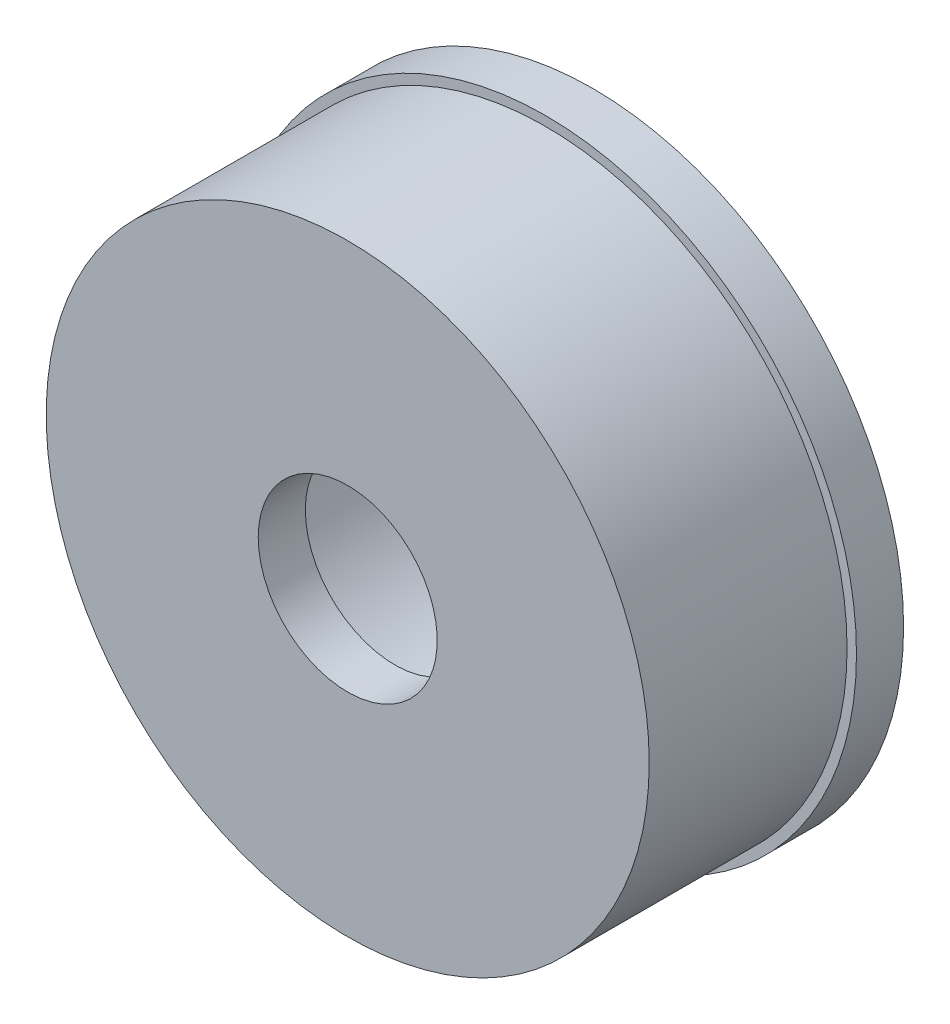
from build123d import *

# Parameters (mm, degrees)
ESQUISSE1_R                  = 33
BASE_EXTRUSION_DEPTH         = 26
ENL_V_START                  = -21
ESQUISSE2_R                  = 33
ESQUISSE2_R_2                = 32
ENL_V_MAT_EXTRU_1_DEPTH      = 21
ESQUISSE3_R                  = 24.5
ENL_V_MAT_EXTRU_2_DEPTH      = 5
ESQUISSE4_R                  = 17.5
ENL_V_MAT_EXTRU_3_DEPTH      = 14
ESQUISSE5_R                  = 16.5
ENL_V_MAT_EXTRU_4_DEPTH      = 2
ESQUISSE6_R                  = 9.5
ENL_V_MAT_EXTRU_5_DEPTH      = 52.176166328
R_P_TITION_CIRCULAIRE1_COUNT = 3


with BuildPart() as part:
    # Esquisse1 → Base-Extrusion (new body)
    with BuildSketch(Plane.XY):
        with Locations(Location((0, 0, 0), (0, 0, 180))):
            Circle(ESQUISSE1_R)
    extrude(amount=BASE_EXTRUSION_DEPTH)

    # Esquisse2 → Enl_v. mat.-Extru.1 (cut)
    with BuildSketch(Plane.XY.offset(26).offset(ENL_V_START)):
        with Locations(Location((0, 0, 0), (0, 0, 180))):
            Circle(ESQUISSE2_R)
        Circle(ESQUISSE2_R_2, mode=Mode.SUBTRACT)
    extrude(amount=ENL_V_MAT_EXTRU_1_DEPTH, mode=Mode.SUBTRACT)

    # Esquisse3 → Enl_v. mat.-Extru.2 (cut)
    with BuildSketch(Plane(origin=(0, 0, 0), x_dir=(-1, 0, 0), z_dir=(0, 0, -1))):
        Circle(ESQUISSE3_R)
    extrude(amount=-ENL_V_MAT_EXTRU_2_DEPTH, mode=Mode.SUBTRACT)

    # Esquisse4 → Enl_v. mat.-Extru.3 (cut)
    with BuildSketch(Plane(origin=(0, 0, 5), x_dir=(-1, 0, 0), z_dir=(0, 0, -1))):
        Circle(ESQUISSE4_R)
    extrude(amount=-ENL_V_MAT_EXTRU_3_DEPTH, mode=Mode.SUBTRACT)

    # Esquisse5 → Enl_v. mat.-Extru.4 (cut)
    with BuildSketch(Plane(origin=(0, 0, 19), x_dir=(-1, 0, 0), z_dir=(0, 0, -1))):
        Circle(ESQUISSE5_R)
    extrude(amount=-ENL_V_MAT_EXTRU_4_DEPTH, mode=Mode.SUBTRACT)

    # Esquisse6 → Enl_v. mat.-Extru.5 (cut, through all)
    with BuildSketch(Plane(origin=(0, 0, 21), x_dir=(-1, 0, 0), z_dir=(0, 0, -1))):
        Circle(ESQUISSE6_R)
    extrude(amount=-ENL_V_MAT_EXTRU_5_DEPTH, mode=Mode.SUBTRACT)

    # Esquisse12 → Trou taraud_ M3.5x0.63 (revolve, cut)
    with BuildSketch(Plane(origin=(0, 20, 5), x_dir=(0, 1, 0), z_dir=(1, 0, 0))):
        Polygon((0, 0), (0, 10.751075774), (1.25, 10), (1.25, 7), (1.5, 7), (1.5, 0), align=None)
    trou_taraud_m3_5x0_63 = revolve(axis=Axis((0, 20, -1.35), (0, 0, 1)), mode=Mode.SUBTRACT)

    # R_p_tition circulaire1: Trou taraud_ M3.5x0.63 ×3 about axis
    r_p_tition_circulaire1_axis = Axis((0, 0, 0), (0, 0, 1))
    for i in range(1, R_P_TITION_CIRCULAIRE1_COUNT):
        add(trou_taraud_m3_5x0_63.rotate(r_p_tition_circulaire1_axis, i * 360 / R_P_TITION_CIRCULAIRE1_COUNT), mode=Mode.SUBTRACT)


solid = part.part
